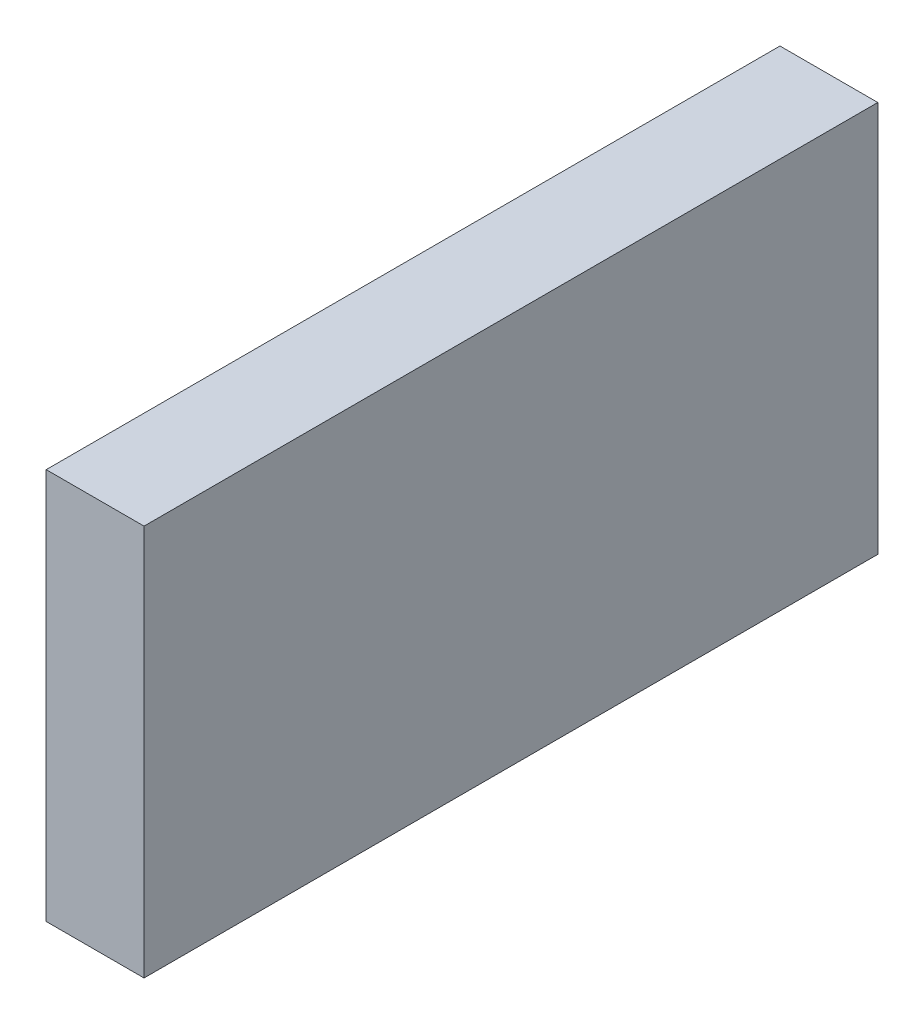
from build123d import *

# Parameters (mm, degrees)
ESQUISSE1_W      = 15
ESQUISSE1_H      = 8
EXTRUSION1_DEPTH = 2


with BuildPart() as part:
    # Esquisse1 → Extrusion1 (new body)
    with BuildSketch(Plane(origin=(0, 0, 0), x_dir=(0, 0, -1), z_dir=(1, 0, 0))):
        with Locations((7.5, 4)):
            Rectangle(ESQUISSE1_W, ESQUISSE1_H)
    extrude(amount=EXTRUSION1_DEPTH)


solid = part.part
